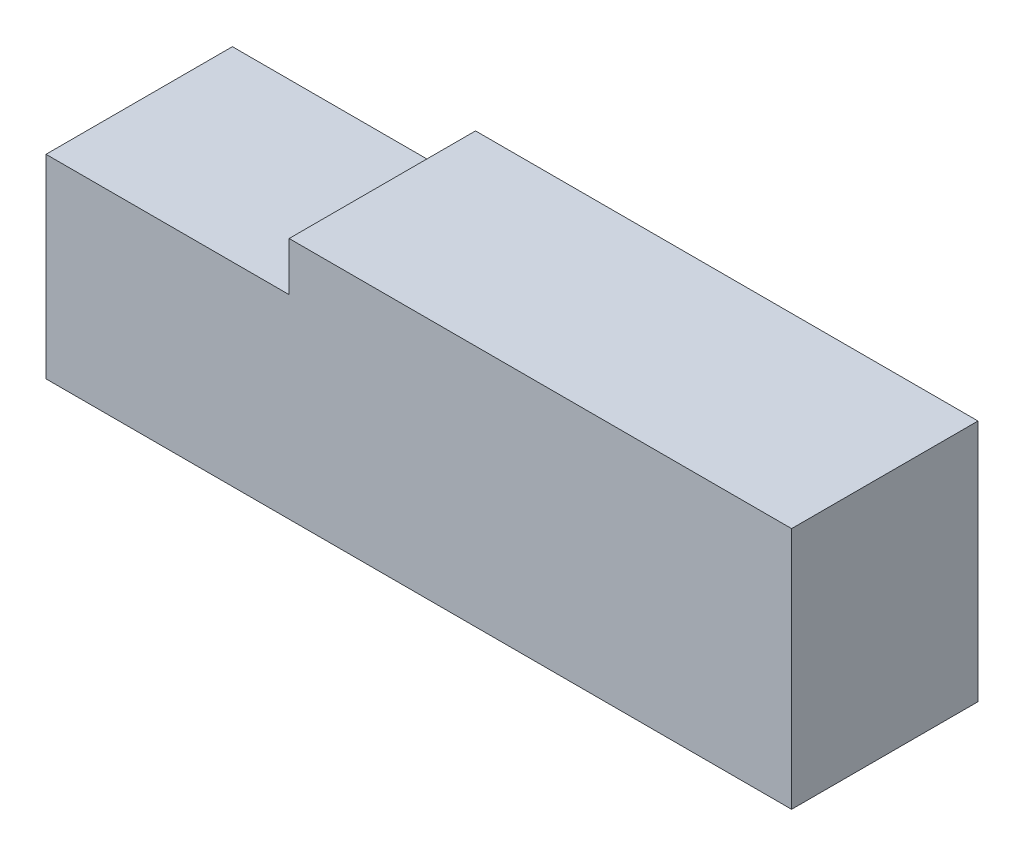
ISO-10303-21;
HEADER;
FILE_DESCRIPTION(('STEP AP214'),'2;1');
FILE_NAME('part.step','',(''),(''),'','','');
FILE_SCHEMA(('AUTOMOTIVE_DESIGN { 1 0 10303 214 1 1 1 1 }'));
ENDSEC;
DATA;
#1=APPLICATION_CONTEXT('core data for automotive mechanical design processes');
#2=APPLICATION_PROTOCOL_DEFINITION('international standard','automotive_design',2000,#1);
#3=PRODUCT_CONTEXT('',#1,'mechanical');
#4=PRODUCT('Part','Part','',(#3));
#5=PRODUCT_RELATED_PRODUCT_CATEGORY('part','',(#4));
#6=PRODUCT_DEFINITION_FORMATION('','',#4);
#7=PRODUCT_DEFINITION_CONTEXT('part definition',#1,'design');
#8=PRODUCT_DEFINITION('design','',#6,#7);
#9=PRODUCT_DEFINITION_SHAPE('','',#8);
#10=(LENGTH_UNIT() NAMED_UNIT(*) SI_UNIT(.MILLI.,.METRE.));
#11=(NAMED_UNIT(*) PLANE_ANGLE_UNIT() SI_UNIT($,.RADIAN.));
#12=(NAMED_UNIT(*) SI_UNIT($,.STERADIAN.) SOLID_ANGLE_UNIT());
#13=UNCERTAINTY_MEASURE_WITH_UNIT(LENGTH_MEASURE(1.E-05),#10,'distance_accuracy_value','');
#14=(GEOMETRIC_REPRESENTATION_CONTEXT(3) GLOBAL_UNCERTAINTY_ASSIGNED_CONTEXT((#13)) GLOBAL_UNIT_ASSIGNED_CONTEXT((#10,
#11,#12)) REPRESENTATION_CONTEXT('',''));
#15=CARTESIAN_POINT('',(0.,0.,0.));
#16=DIRECTION('',(0.,0.,1.));
#17=DIRECTION('',(1.,0.,0.));
#18=AXIS2_PLACEMENT_3D('',#15,#16,#17);
#19=CARTESIAN_POINT('',(-115.,37.5,-28.75));
#20=DIRECTION('',(1.,0.,0.));
#21=DIRECTION('',(0.,0.,-1.));
#22=AXIS2_PLACEMENT_3D('',#19,#20,#21);
#23=PLANE('',#22);
#24=DIRECTION('',(0.,0.,1.));
#25=VECTOR('',#24,1.);
#26=CARTESIAN_POINT('',(-115.,22.5,-28.75));
#27=LINE('',#26,#25);
#28=CARTESIAN_POINT('',(-115.,22.5,-28.75));
#29=VERTEX_POINT('',#28);
#30=CARTESIAN_POINT('',(-115.,22.5,28.75));
#31=VERTEX_POINT('',#30);
#32=EDGE_CURVE('E125',#29,#31,#27,.T.);
#33=ORIENTED_EDGE('',*,*,#32,.F.);
#34=DIRECTION('',(0.,-1.,0.));
#35=VECTOR('',#34,1.);
#36=CARTESIAN_POINT('',(-115.,37.5,-28.75));
#37=LINE('',#36,#35);
#38=CARTESIAN_POINT('',(-115.,-37.5,-28.75));
#39=VERTEX_POINT('',#38);
#40=EDGE_CURVE('E47',#29,#39,#37,.T.);
#41=ORIENTED_EDGE('',*,*,#40,.T.);
#42=DIRECTION('',(0.,0.,1.));
#43=VECTOR('',#42,1.);
#44=CARTESIAN_POINT('',(-115.,-37.5,-28.75));
#45=LINE('',#44,#43);
#46=CARTESIAN_POINT('',(-115.,-37.5,28.75));
#47=VERTEX_POINT('',#46);
#48=EDGE_CURVE('E95',#39,#47,#45,.T.);
#49=ORIENTED_EDGE('',*,*,#48,.T.);
#50=DIRECTION('',(0.,-1.,0.));
#51=VECTOR('',#50,1.);
#52=CARTESIAN_POINT('',(-115.,37.5,28.75));
#53=LINE('',#52,#51);
#54=EDGE_CURVE('E88',#31,#47,#53,.T.);
#55=ORIENTED_EDGE('',*,*,#54,.F.);
#56=EDGE_LOOP('',(#33,#41,#49,#55));
#57=FACE_BOUND('',#56,.T.);
#58=ADVANCED_FACE('F38',(#57),#23,.F.);
#59=CARTESIAN_POINT('',(115.,37.5,-28.75));
#60=DIRECTION('',(-1.,0.,0.));
#61=DIRECTION('',(0.,0.,1.));
#62=AXIS2_PLACEMENT_3D('',#59,#60,#61);
#63=PLANE('',#62);
#64=DIRECTION('',(0.,0.,-1.));
#65=VECTOR('',#64,1.);
#66=CARTESIAN_POINT('',(115.,-37.5,-28.75));
#67=LINE('',#66,#65);
#68=CARTESIAN_POINT('',(115.,-37.5,28.75));
#69=VERTEX_POINT('',#68);
#70=CARTESIAN_POINT('',(115.,-37.5,-28.75));
#71=VERTEX_POINT('',#70);
#72=EDGE_CURVE('E100',#69,#71,#67,.T.);
#73=ORIENTED_EDGE('',*,*,#72,.T.);
#74=DIRECTION('',(0.,-1.,0.));
#75=VECTOR('',#74,1.);
#76=CARTESIAN_POINT('',(115.,37.5,-28.75));
#77=LINE('',#76,#75);
#78=CARTESIAN_POINT('',(115.,37.5,-28.75));
#79=VERTEX_POINT('',#78);
#80=EDGE_CURVE('E11',#79,#71,#77,.T.);
#81=ORIENTED_EDGE('',*,*,#80,.F.);
#82=DIRECTION('',(0.,0.,-1.));
#83=VECTOR('',#82,1.);
#84=CARTESIAN_POINT('',(115.,37.5,-28.75));
#85=LINE('',#84,#83);
#86=CARTESIAN_POINT('',(115.,37.5,28.75));
#87=VERTEX_POINT('',#86);
#88=EDGE_CURVE('E94',#87,#79,#85,.T.);
#89=ORIENTED_EDGE('',*,*,#88,.F.);
#90=DIRECTION('',(0.,-1.,0.));
#91=VECTOR('',#90,1.);
#92=CARTESIAN_POINT('',(115.,37.5,28.75));
#93=LINE('',#92,#91);
#94=EDGE_CURVE('E84',#87,#69,#93,.T.);
#95=ORIENTED_EDGE('',*,*,#94,.T.);
#96=EDGE_LOOP('',(#73,#81,#89,#95));
#97=FACE_BOUND('',#96,.T.);
#98=ADVANCED_FACE('F40',(#97),#63,.F.);
#99=CARTESIAN_POINT('',(-115.,37.5,-28.75));
#100=DIRECTION('',(0.,0.,1.));
#101=DIRECTION('',(1.,0.,0.));
#102=AXIS2_PLACEMENT_3D('',#99,#100,#101);
#103=PLANE('',#102);
#104=DIRECTION('',(-1.,0.,0.));
#105=VECTOR('',#104,1.);
#106=CARTESIAN_POINT('',(-115.,22.5,-28.75));
#107=LINE('',#106,#105);
#108=CARTESIAN_POINT('',(-40.,22.5,-28.75));
#109=VERTEX_POINT('',#108);
#110=EDGE_CURVE('E139',#109,#29,#107,.T.);
#111=ORIENTED_EDGE('',*,*,#110,.F.);
#112=DIRECTION('',(0.,1.,0.));
#113=VECTOR('',#112,1.);
#114=CARTESIAN_POINT('',(-40.,22.5,-28.75));
#115=LINE('',#114,#113);
#116=CARTESIAN_POINT('',(-40.,37.5,-28.75));
#117=VERTEX_POINT('',#116);
#118=EDGE_CURVE('E107',#109,#117,#115,.T.);
#119=ORIENTED_EDGE('',*,*,#118,.T.);
#120=DIRECTION('',(-1.,0.,0.));
#121=VECTOR('',#120,1.);
#122=CARTESIAN_POINT('',(-115.,37.5,-28.75));
#123=LINE('',#122,#121);
#124=EDGE_CURVE('E130',#79,#117,#123,.T.);
#125=ORIENTED_EDGE('',*,*,#124,.F.);
#126=ORIENTED_EDGE('',*,*,#80,.T.);
#127=DIRECTION('',(-1.,0.,0.));
#128=VECTOR('',#127,1.);
#129=CARTESIAN_POINT('',(-115.,-37.5,-28.75));
#130=LINE('',#129,#128);
#131=EDGE_CURVE('E105',#71,#39,#130,.T.);
#132=ORIENTED_EDGE('',*,*,#131,.T.);
#133=ORIENTED_EDGE('',*,*,#40,.F.);
#134=EDGE_LOOP('',(#111,#119,#125,#126,#132,#133));
#135=FACE_BOUND('',#134,.T.);
#136=ADVANCED_FACE('F128',(#135),#103,.F.);
#137=CARTESIAN_POINT('',(-115.,37.5,28.75));
#138=DIRECTION('',(0.,0.,-1.));
#139=DIRECTION('',(-1.,0.,0.));
#140=AXIS2_PLACEMENT_3D('',#137,#138,#139);
#141=PLANE('',#140);
#142=DIRECTION('',(1.,0.,0.));
#143=VECTOR('',#142,1.);
#144=CARTESIAN_POINT('',(-115.,37.5,28.75));
#145=LINE('',#144,#143);
#146=CARTESIAN_POINT('',(-40.,37.5,28.75));
#147=VERTEX_POINT('',#146);
#148=EDGE_CURVE('E62',#147,#87,#145,.T.);
#149=ORIENTED_EDGE('',*,*,#148,.F.);
#150=DIRECTION('',(0.,1.,0.));
#151=VECTOR('',#150,1.);
#152=CARTESIAN_POINT('',(-40.,22.5,28.75));
#153=LINE('',#152,#151);
#154=CARTESIAN_POINT('',(-40.,22.5,28.75));
#155=VERTEX_POINT('',#154);
#156=EDGE_CURVE('E54',#155,#147,#153,.T.);
#157=ORIENTED_EDGE('',*,*,#156,.F.);
#158=DIRECTION('',(1.,0.,0.));
#159=VECTOR('',#158,1.);
#160=CARTESIAN_POINT('',(-115.,22.5,28.75));
#161=LINE('',#160,#159);
#162=EDGE_CURVE('E151',#31,#155,#161,.T.);
#163=ORIENTED_EDGE('',*,*,#162,.F.);
#164=ORIENTED_EDGE('',*,*,#54,.T.);
#165=DIRECTION('',(1.,0.,0.));
#166=VECTOR('',#165,1.);
#167=CARTESIAN_POINT('',(-115.,-37.5,28.75));
#168=LINE('',#167,#166);
#169=EDGE_CURVE('E81',#47,#69,#168,.T.);
#170=ORIENTED_EDGE('',*,*,#169,.T.);
#171=ORIENTED_EDGE('',*,*,#94,.F.);
#172=EDGE_LOOP('',(#149,#157,#163,#164,#170,#171));
#173=FACE_BOUND('',#172,.T.);
#174=ADVANCED_FACE('F83',(#173),#141,.F.);
#175=CARTESIAN_POINT('',(0.,37.5,0.));
#176=DIRECTION('',(0.,1.,0.));
#177=DIRECTION('',(0.,0.,1.));
#178=AXIS2_PLACEMENT_3D('',#175,#176,#177);
#179=PLANE('',#178);
#180=DIRECTION('',(0.,0.,-1.));
#181=VECTOR('',#180,1.);
#182=CARTESIAN_POINT('',(-40.,37.5,-28.75));
#183=LINE('',#182,#181);
#184=EDGE_CURVE('E141',#147,#117,#183,.T.);
#185=ORIENTED_EDGE('',*,*,#184,.F.);
#186=ORIENTED_EDGE('',*,*,#148,.T.);
#187=ORIENTED_EDGE('',*,*,#88,.T.);
#188=ORIENTED_EDGE('',*,*,#124,.T.);
#189=EDGE_LOOP('',(#185,#186,#187,#188));
#190=FACE_BOUND('',#189,.T.);
#191=ADVANCED_FACE('F134',(#190),#179,.T.);
#192=CARTESIAN_POINT('',(0.,-37.5,0.));
#193=DIRECTION('',(0.,1.,0.));
#194=DIRECTION('',(0.,0.,1.));
#195=AXIS2_PLACEMENT_3D('',#192,#193,#194);
#196=PLANE('',#195);
#197=ORIENTED_EDGE('',*,*,#72,.F.);
#198=ORIENTED_EDGE('',*,*,#169,.F.);
#199=ORIENTED_EDGE('',*,*,#48,.F.);
#200=ORIENTED_EDGE('',*,*,#131,.F.);
#201=EDGE_LOOP('',(#197,#198,#199,#200));
#202=FACE_BOUND('',#201,.T.);
#203=ADVANCED_FACE('F103',(#202),#196,.F.);
#204=CARTESIAN_POINT('',(-40.,22.5,-28.75));
#205=DIRECTION('',(1.,0.,0.));
#206=DIRECTION('',(0.,0.,-1.));
#207=AXIS2_PLACEMENT_3D('',#204,#205,#206);
#208=PLANE('',#207);
#209=ORIENTED_EDGE('',*,*,#184,.T.);
#210=ORIENTED_EDGE('',*,*,#118,.F.);
#211=DIRECTION('',(0.,0.,-1.));
#212=VECTOR('',#211,1.);
#213=CARTESIAN_POINT('',(-40.,22.5,-28.75));
#214=LINE('',#213,#212);
#215=EDGE_CURVE('E147',#155,#109,#214,.T.);
#216=ORIENTED_EDGE('',*,*,#215,.F.);
#217=ORIENTED_EDGE('',*,*,#156,.T.);
#218=EDGE_LOOP('',(#209,#210,#216,#217));
#219=FACE_BOUND('',#218,.T.);
#220=ADVANCED_FACE('F165',(#219),#208,.F.);
#221=CARTESIAN_POINT('',(0.,22.5,0.));
#222=DIRECTION('',(0.,1.,0.));
#223=DIRECTION('',(0.,0.,1.));
#224=AXIS2_PLACEMENT_3D('',#221,#222,#223);
#225=PLANE('',#224);
#226=ORIENTED_EDGE('',*,*,#32,.T.);
#227=ORIENTED_EDGE('',*,*,#162,.T.);
#228=ORIENTED_EDGE('',*,*,#215,.T.);
#229=ORIENTED_EDGE('',*,*,#110,.T.);
#230=EDGE_LOOP('',(#226,#227,#228,#229));
#231=FACE_BOUND('',#230,.T.);
#232=ADVANCED_FACE('F158',(#231),#225,.T.);
#233=CLOSED_SHELL('',(#58,#98,#136,#174,#191,#203,#220,#232));
#234=MANIFOLD_SOLID_BREP('B2',#233);
#235=ADVANCED_BREP_SHAPE_REPRESENTATION('',(#18,#234),#14);
#236=SHAPE_DEFINITION_REPRESENTATION(#9,#235);
ENDSEC;
END-ISO-10303-21;
